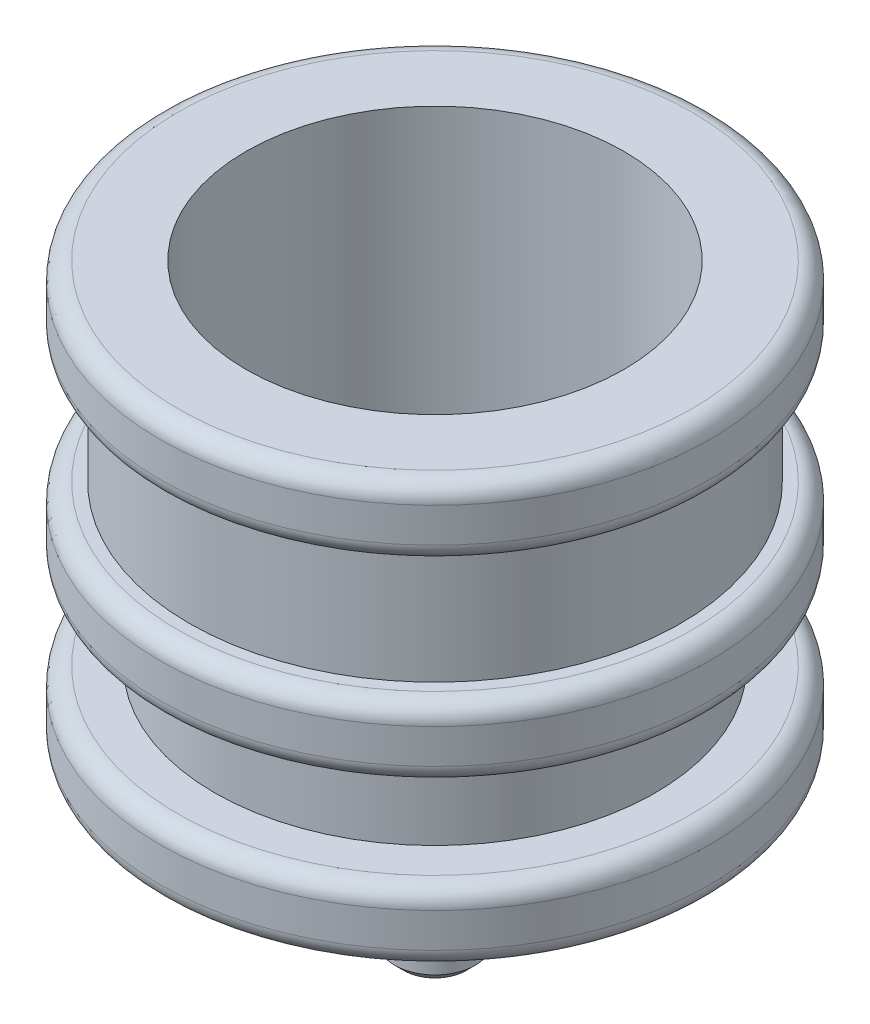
from build123d import *

# Parameters (mm, degrees)
SKETCH7_R           = 2.6924
CUT_EXTRUDE1_DEPTH  = 4.499991
FILLET1_R           = 0.254
SKETCH8_R           = 0.5715
BOSS_EXTRUDE1_DEPTH = 2.54
CHAMFER1_SIZE       = 0.127


with BuildPart() as part:
    # Sketch1 → Revolve1 (revolve)
    with BuildSketch(Plane.XY, mode=Mode.PRIVATE) as revolve1_sk:
        Polygon((3.915, 2.27), (3.915, 3.27), (3.5, 3.27), (3.5, 5), (3.915, 5), (3.915, 6), (0, 6), (0, 0), (3.915, 0), (3.915, 1), (3.14, 1), (3.14, 2.27), align=None)
    revolve(revolve1_sk.sketch.rotate(Axis((0, 11.048100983, 0), (0, -1, 0)), 90), axis=Axis((0, 11.048100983, 0), (0, -1, 0)))

    # Sketch7 → Cut-Extrude1 (cut)
    with BuildSketch(Plane(origin=(0, 6, 0), x_dir=(1, 0, 0), z_dir=(0, 1, 0))):
        with Locations(Location((0, 0, 0), (0, 0, 270))):
            Circle(SKETCH7_R)
    extrude(amount=-CUT_EXTRUDE1_DEPTH, mode=Mode.SUBTRACT)

    # Fillet1
    fillet1_edges = [part.edges().sort_by_distance(p)[0] for p in [
        (0, 3.27, -3.915),
        (0, 2.27, -3.915),
        (0, 1, -3.915),
        (0, 0, -3.915),
        (0, 6, -3.915),
        (0, 5, -3.915),
    ]]
    fillet(fillet1_edges, radius=FILLET1_R)

    # Sketch8 → Boss-Extrude1 (add)
    with BuildSketch(Plane.XZ):
        with Locations(Location((0, 0, 0), (0, 0, 90))):
            Circle(SKETCH8_R)
    extrude(amount=BOSS_EXTRUDE1_DEPTH)

    # Chamfer1
    chamfer1_edges = [part.edges().sort_by_distance(p)[0] for p in [
        (0, -2.54, -0.5715),
    ]]
    chamfer(chamfer1_edges, length=CHAMFER1_SIZE)


solid = part.part
